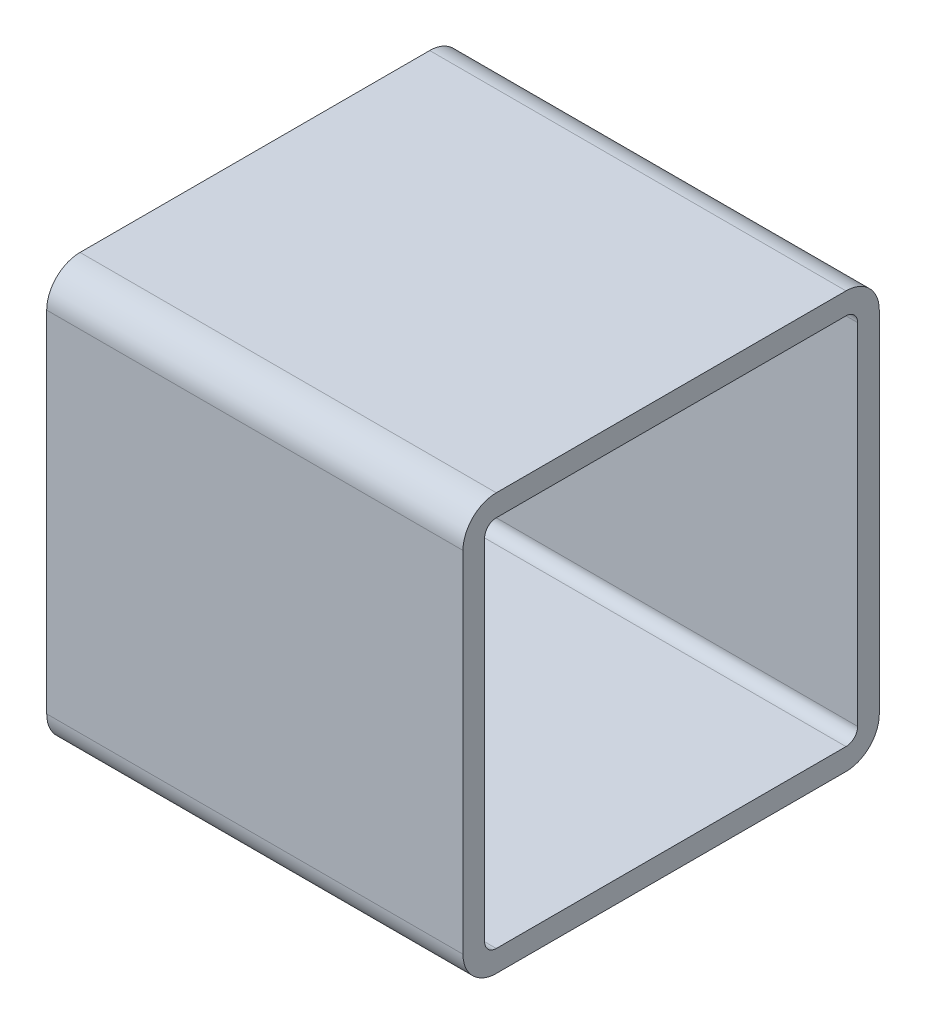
ISO-10303-21;
HEADER;
FILE_DESCRIPTION(('STEP AP214'),'2;1');
FILE_NAME('part.step','',(''),(''),'','','');
FILE_SCHEMA(('AUTOMOTIVE_DESIGN { 1 0 10303 214 1 1 1 1 }'));
ENDSEC;
DATA;
#1=APPLICATION_CONTEXT('core data for automotive mechanical design processes');
#2=APPLICATION_PROTOCOL_DEFINITION('international standard','automotive_design',2000,#1);
#3=PRODUCT_CONTEXT('',#1,'mechanical');
#4=PRODUCT('Part','Part','',(#3));
#5=PRODUCT_RELATED_PRODUCT_CATEGORY('part','',(#4));
#6=PRODUCT_DEFINITION_FORMATION('','',#4);
#7=PRODUCT_DEFINITION_CONTEXT('part definition',#1,'design');
#8=PRODUCT_DEFINITION('design','',#6,#7);
#9=PRODUCT_DEFINITION_SHAPE('','',#8);
#10=(LENGTH_UNIT() NAMED_UNIT(*) SI_UNIT(.MILLI.,.METRE.));
#11=(NAMED_UNIT(*) PLANE_ANGLE_UNIT() SI_UNIT($,.RADIAN.));
#12=(NAMED_UNIT(*) SI_UNIT($,.STERADIAN.) SOLID_ANGLE_UNIT());
#13=UNCERTAINTY_MEASURE_WITH_UNIT(LENGTH_MEASURE(1.E-05),#10,'distance_accuracy_value','');
#14=(GEOMETRIC_REPRESENTATION_CONTEXT(3) GLOBAL_UNCERTAINTY_ASSIGNED_CONTEXT((#13)) GLOBAL_UNIT_ASSIGNED_CONTEXT((#10,
#11,#12)) REPRESENTATION_CONTEXT('',''));
#15=CARTESIAN_POINT('',(0.,0.,0.));
#16=DIRECTION('',(0.,0.,1.));
#17=DIRECTION('',(1.,0.,0.));
#18=AXIS2_PLACEMENT_3D('',#15,#16,#17);
#19=CARTESIAN_POINT('',(31.75,2.54,29.21));
#20=DIRECTION('',(1.,0.,0.));
#21=DIRECTION('',(0.,0.,-1.));
#22=AXIS2_PLACEMENT_3D('',#19,#20,#21);
#23=PLANE('',#22);
#24=CARTESIAN_POINT('',(31.75,2.54,29.21));
#25=DIRECTION('',(1.,0.,0.));
#26=DIRECTION('',(0.,0.,-1.));
#27=AXIS2_PLACEMENT_3D('',#24,#25,#26);
#28=CIRCLE('',#27,2.54);
#29=CARTESIAN_POINT('',(31.75,2.54000000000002,31.75));
#30=VERTEX_POINT('',#29);
#31=CARTESIAN_POINT('',(31.75,0.,29.21));
#32=VERTEX_POINT('',#31);
#33=EDGE_CURVE('E217',#30,#32,#28,.T.);
#34=ORIENTED_EDGE('',*,*,#33,.T.);
#35=DIRECTION('',(0.,0.,-1.));
#36=VECTOR('',#35,1.);
#37=CARTESIAN_POINT('',(31.75,0.,29.21));
#38=LINE('',#37,#36);
#39=CARTESIAN_POINT('',(31.75,0.,2.54000000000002));
#40=VERTEX_POINT('',#39);
#41=EDGE_CURVE('E220',#32,#40,#38,.T.);
#42=ORIENTED_EDGE('',*,*,#41,.T.);
#43=CARTESIAN_POINT('',(31.75,2.54,2.54));
#44=DIRECTION('',(1.,0.,0.));
#45=DIRECTION('',(0.,0.,1.));
#46=AXIS2_PLACEMENT_3D('',#43,#44,#45);
#47=CIRCLE('',#46,2.54);
#48=CARTESIAN_POINT('',(31.75,2.54000000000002,0.));
#49=VERTEX_POINT('',#48);
#50=EDGE_CURVE('E223',#40,#49,#47,.T.);
#51=ORIENTED_EDGE('',*,*,#50,.T.);
#52=DIRECTION('',(0.,1.,0.));
#53=VECTOR('',#52,1.);
#54=CARTESIAN_POINT('',(31.75,2.54000000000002,0.));
#55=LINE('',#54,#53);
#56=CARTESIAN_POINT('',(31.75,29.21,0.));
#57=VERTEX_POINT('',#56);
#58=EDGE_CURVE('E225',#49,#57,#55,.T.);
#59=ORIENTED_EDGE('',*,*,#58,.T.);
#60=CARTESIAN_POINT('',(31.75,29.21,2.54));
#61=DIRECTION('',(1.,0.,0.));
#62=DIRECTION('',(0.,0.,-1.));
#63=AXIS2_PLACEMENT_3D('',#60,#61,#62);
#64=CIRCLE('',#63,2.54);
#65=CARTESIAN_POINT('',(31.75,31.75,2.54000000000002));
#66=VERTEX_POINT('',#65);
#67=EDGE_CURVE('E227',#57,#66,#64,.T.);
#68=ORIENTED_EDGE('',*,*,#67,.T.);
#69=DIRECTION('',(0.,0.,1.));
#70=VECTOR('',#69,1.);
#71=CARTESIAN_POINT('',(31.75,31.75,2.54000000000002));
#72=LINE('',#71,#70);
#73=CARTESIAN_POINT('',(31.75,31.75,29.21));
#74=VERTEX_POINT('',#73);
#75=EDGE_CURVE('E229',#66,#74,#72,.T.);
#76=ORIENTED_EDGE('',*,*,#75,.T.);
#77=CARTESIAN_POINT('',(31.75,29.21,29.21));
#78=DIRECTION('',(1.,0.,0.));
#79=DIRECTION('',(0.,0.,1.));
#80=AXIS2_PLACEMENT_3D('',#77,#78,#79);
#81=CIRCLE('',#80,2.54);
#82=CARTESIAN_POINT('',(31.75,29.21,31.75));
#83=VERTEX_POINT('',#82);
#84=EDGE_CURVE('E231',#74,#83,#81,.T.);
#85=ORIENTED_EDGE('',*,*,#84,.T.);
#86=DIRECTION('',(0.,-1.,0.));
#87=VECTOR('',#86,1.);
#88=CARTESIAN_POINT('',(31.75,29.21,31.75));
#89=LINE('',#88,#87);
#90=EDGE_CURVE('E233',#83,#30,#89,.T.);
#91=ORIENTED_EDGE('',*,*,#90,.T.);
#92=EDGE_LOOP('',(#34,#42,#51,#59,#68,#76,#85,#91));
#93=FACE_BOUND('',#92,.T.);
#94=DIRECTION('',(0.,1.,0.));
#95=VECTOR('',#94,1.);
#96=CARTESIAN_POINT('',(31.75,2.54000000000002,1.651));
#97=LINE('',#96,#95);
#98=CARTESIAN_POINT('',(31.75,2.54000000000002,1.651));
#99=VERTEX_POINT('',#98);
#100=CARTESIAN_POINT('',(31.75,29.21,1.651));
#101=VERTEX_POINT('',#100);
#102=EDGE_CURVE('E160',#99,#101,#97,.T.);
#103=ORIENTED_EDGE('',*,*,#102,.F.);
#104=CARTESIAN_POINT('',(31.75,2.54,2.54));
#105=DIRECTION('',(1.,0.,0.));
#106=DIRECTION('',(0.,0.,1.));
#107=AXIS2_PLACEMENT_3D('',#104,#105,#106);
#108=CIRCLE('',#107,0.889);
#109=CARTESIAN_POINT('',(31.75,1.651,2.54000000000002));
#110=VERTEX_POINT('',#109);
#111=EDGE_CURVE('E152',#110,#99,#108,.T.);
#112=ORIENTED_EDGE('',*,*,#111,.F.);
#113=DIRECTION('',(0.,0.,-1.));
#114=VECTOR('',#113,1.);
#115=CARTESIAN_POINT('',(31.75,1.651,29.21));
#116=LINE('',#115,#114);
#117=CARTESIAN_POINT('',(31.75,1.651,29.21));
#118=VERTEX_POINT('',#117);
#119=EDGE_CURVE('E185',#118,#110,#116,.T.);
#120=ORIENTED_EDGE('',*,*,#119,.F.);
#121=CARTESIAN_POINT('',(31.75,2.54,29.21));
#122=DIRECTION('',(1.,0.,0.));
#123=DIRECTION('',(0.,0.,-1.));
#124=AXIS2_PLACEMENT_3D('',#121,#122,#123);
#125=CIRCLE('',#124,0.889000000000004);
#126=CARTESIAN_POINT('',(31.75,2.54000000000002,30.099));
#127=VERTEX_POINT('',#126);
#128=EDGE_CURVE('E183',#127,#118,#125,.T.);
#129=ORIENTED_EDGE('',*,*,#128,.F.);
#130=DIRECTION('',(0.,-1.,0.));
#131=VECTOR('',#130,1.);
#132=CARTESIAN_POINT('',(31.75,29.21,30.099));
#133=LINE('',#132,#131);
#134=CARTESIAN_POINT('',(31.75,29.21,30.099));
#135=VERTEX_POINT('',#134);
#136=EDGE_CURVE('E181',#135,#127,#133,.T.);
#137=ORIENTED_EDGE('',*,*,#136,.F.);
#138=CARTESIAN_POINT('',(31.75,29.21,29.21));
#139=DIRECTION('',(1.,0.,0.));
#140=DIRECTION('',(0.,0.,1.));
#141=AXIS2_PLACEMENT_3D('',#138,#139,#140);
#142=CIRCLE('',#141,0.889000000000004);
#143=CARTESIAN_POINT('',(31.75,30.099,29.21));
#144=VERTEX_POINT('',#143);
#145=EDGE_CURVE('E179',#144,#135,#142,.T.);
#146=ORIENTED_EDGE('',*,*,#145,.F.);
#147=DIRECTION('',(0.,0.,1.));
#148=VECTOR('',#147,1.);
#149=CARTESIAN_POINT('',(31.75,30.099,2.54000000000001));
#150=LINE('',#149,#148);
#151=CARTESIAN_POINT('',(31.75,30.099,2.54000000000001));
#152=VERTEX_POINT('',#151);
#153=EDGE_CURVE('E175',#152,#144,#150,.T.);
#154=ORIENTED_EDGE('',*,*,#153,.F.);
#155=CARTESIAN_POINT('',(31.75,29.21,2.54));
#156=DIRECTION('',(1.,0.,0.));
#157=DIRECTION('',(0.,0.,-1.));
#158=AXIS2_PLACEMENT_3D('',#155,#156,#157);
#159=CIRCLE('',#158,0.889);
#160=EDGE_CURVE('E173',#101,#152,#159,.T.);
#161=ORIENTED_EDGE('',*,*,#160,.F.);
#162=EDGE_LOOP('',(#103,#112,#120,#129,#137,#146,#154,#161));
#163=FACE_BOUND('',#162,.T.);
#164=ADVANCED_FACE('F39',(#93,#163),#23,.T.);
#165=CARTESIAN_POINT('',(0.,2.54,29.21));
#166=DIRECTION('',(1.,0.,0.));
#167=DIRECTION('',(0.,0.,-1.));
#168=AXIS2_PLACEMENT_3D('',#165,#166,#167);
#169=PLANE('',#168);
#170=CARTESIAN_POINT('',(0.,2.54,29.21));
#171=DIRECTION('',(1.,0.,0.));
#172=DIRECTION('',(0.,0.,-1.));
#173=AXIS2_PLACEMENT_3D('',#170,#171,#172);
#174=CIRCLE('',#173,2.54);
#175=CARTESIAN_POINT('',(0.,2.54000000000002,31.75));
#176=VERTEX_POINT('',#175);
#177=CARTESIAN_POINT('',(0.,0.,29.21));
#178=VERTEX_POINT('',#177);
#179=EDGE_CURVE('E168',#176,#178,#174,.T.);
#180=ORIENTED_EDGE('',*,*,#179,.F.);
#181=DIRECTION('',(0.,-1.,0.));
#182=VECTOR('',#181,1.);
#183=CARTESIAN_POINT('',(0.,29.21,31.75));
#184=LINE('',#183,#182);
#185=CARTESIAN_POINT('',(0.,29.21,31.75));
#186=VERTEX_POINT('',#185);
#187=EDGE_CURVE('E221',#186,#176,#184,.T.);
#188=ORIENTED_EDGE('',*,*,#187,.F.);
#189=CARTESIAN_POINT('',(0.,29.21,29.21));
#190=DIRECTION('',(1.,0.,0.));
#191=DIRECTION('',(0.,0.,1.));
#192=AXIS2_PLACEMENT_3D('',#189,#190,#191);
#193=CIRCLE('',#192,2.54);
#194=CARTESIAN_POINT('',(0.,31.75,29.21));
#195=VERTEX_POINT('',#194);
#196=EDGE_CURVE('E248',#195,#186,#193,.T.);
#197=ORIENTED_EDGE('',*,*,#196,.F.);
#198=DIRECTION('',(0.,0.,1.));
#199=VECTOR('',#198,1.);
#200=CARTESIAN_POINT('',(0.,31.75,2.54000000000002));
#201=LINE('',#200,#199);
#202=CARTESIAN_POINT('',(0.,31.75,2.54000000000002));
#203=VERTEX_POINT('',#202);
#204=EDGE_CURVE('E246',#203,#195,#201,.T.);
#205=ORIENTED_EDGE('',*,*,#204,.F.);
#206=CARTESIAN_POINT('',(0.,29.21,2.54));
#207=DIRECTION('',(1.,0.,0.));
#208=DIRECTION('',(0.,0.,-1.));
#209=AXIS2_PLACEMENT_3D('',#206,#207,#208);
#210=CIRCLE('',#209,2.54);
#211=CARTESIAN_POINT('',(0.,29.21,0.));
#212=VERTEX_POINT('',#211);
#213=EDGE_CURVE('E244',#212,#203,#210,.T.);
#214=ORIENTED_EDGE('',*,*,#213,.F.);
#215=DIRECTION('',(0.,1.,0.));
#216=VECTOR('',#215,1.);
#217=CARTESIAN_POINT('',(0.,2.54000000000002,0.));
#218=LINE('',#217,#216);
#219=CARTESIAN_POINT('',(0.,2.54000000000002,0.));
#220=VERTEX_POINT('',#219);
#221=EDGE_CURVE('E242',#220,#212,#218,.T.);
#222=ORIENTED_EDGE('',*,*,#221,.F.);
#223=CARTESIAN_POINT('',(0.,2.54,2.54));
#224=DIRECTION('',(1.,0.,0.));
#225=DIRECTION('',(0.,0.,1.));
#226=AXIS2_PLACEMENT_3D('',#223,#224,#225);
#227=CIRCLE('',#226,2.54);
#228=CARTESIAN_POINT('',(0.,0.,2.54000000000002));
#229=VERTEX_POINT('',#228);
#230=EDGE_CURVE('E240',#229,#220,#227,.T.);
#231=ORIENTED_EDGE('',*,*,#230,.F.);
#232=DIRECTION('',(0.,0.,-1.));
#233=VECTOR('',#232,1.);
#234=CARTESIAN_POINT('',(0.,0.,29.21));
#235=LINE('',#234,#233);
#236=EDGE_CURVE('E238',#178,#229,#235,.T.);
#237=ORIENTED_EDGE('',*,*,#236,.F.);
#238=EDGE_LOOP('',(#180,#188,#197,#205,#214,#222,#231,#237));
#239=FACE_BOUND('',#238,.T.);
#240=CARTESIAN_POINT('',(0.,2.54,2.54));
#241=DIRECTION('',(1.,0.,0.));
#242=DIRECTION('',(0.,0.,1.));
#243=AXIS2_PLACEMENT_3D('',#240,#241,#242);
#244=CIRCLE('',#243,0.889);
#245=CARTESIAN_POINT('',(0.,1.651,2.54000000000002));
#246=VERTEX_POINT('',#245);
#247=CARTESIAN_POINT('',(0.,2.54000000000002,1.651));
#248=VERTEX_POINT('',#247);
#249=EDGE_CURVE('E62',#246,#248,#244,.T.);
#250=ORIENTED_EDGE('',*,*,#249,.T.);
#251=DIRECTION('',(0.,1.,0.));
#252=VECTOR('',#251,1.);
#253=CARTESIAN_POINT('',(0.,2.54000000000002,1.651));
#254=LINE('',#253,#252);
#255=CARTESIAN_POINT('',(0.,29.21,1.651));
#256=VERTEX_POINT('',#255);
#257=EDGE_CURVE('E167',#248,#256,#254,.T.);
#258=ORIENTED_EDGE('',*,*,#257,.T.);
#259=CARTESIAN_POINT('',(0.,29.21,2.54));
#260=DIRECTION('',(1.,0.,0.));
#261=DIRECTION('',(0.,0.,-1.));
#262=AXIS2_PLACEMENT_3D('',#259,#260,#261);
#263=CIRCLE('',#262,0.889);
#264=CARTESIAN_POINT('',(0.,30.099,2.54000000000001));
#265=VERTEX_POINT('',#264);
#266=EDGE_CURVE('E189',#256,#265,#263,.T.);
#267=ORIENTED_EDGE('',*,*,#266,.T.);
#268=DIRECTION('',(0.,0.,1.));
#269=VECTOR('',#268,1.);
#270=CARTESIAN_POINT('',(0.,30.099,2.54000000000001));
#271=LINE('',#270,#269);
#272=CARTESIAN_POINT('',(0.,30.099,29.21));
#273=VERTEX_POINT('',#272);
#274=EDGE_CURVE('E192',#265,#273,#271,.T.);
#275=ORIENTED_EDGE('',*,*,#274,.T.);
#276=CARTESIAN_POINT('',(0.,29.21,29.21));
#277=DIRECTION('',(1.,0.,0.));
#278=DIRECTION('',(0.,0.,1.));
#279=AXIS2_PLACEMENT_3D('',#276,#277,#278);
#280=CIRCLE('',#279,0.889000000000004);
#281=CARTESIAN_POINT('',(0.,29.21,30.099));
#282=VERTEX_POINT('',#281);
#283=EDGE_CURVE('E195',#273,#282,#280,.T.);
#284=ORIENTED_EDGE('',*,*,#283,.T.);
#285=DIRECTION('',(0.,-1.,0.));
#286=VECTOR('',#285,1.);
#287=CARTESIAN_POINT('',(0.,29.21,30.099));
#288=LINE('',#287,#286);
#289=CARTESIAN_POINT('',(0.,2.54000000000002,30.099));
#290=VERTEX_POINT('',#289);
#291=EDGE_CURVE('E198',#282,#290,#288,.T.);
#292=ORIENTED_EDGE('',*,*,#291,.T.);
#293=CARTESIAN_POINT('',(0.,2.54,29.21));
#294=DIRECTION('',(1.,0.,0.));
#295=DIRECTION('',(0.,0.,-1.));
#296=AXIS2_PLACEMENT_3D('',#293,#294,#295);
#297=CIRCLE('',#296,0.889000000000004);
#298=CARTESIAN_POINT('',(0.,1.651,29.21));
#299=VERTEX_POINT('',#298);
#300=EDGE_CURVE('E201',#290,#299,#297,.T.);
#301=ORIENTED_EDGE('',*,*,#300,.T.);
#302=DIRECTION('',(0.,0.,-1.));
#303=VECTOR('',#302,1.);
#304=CARTESIAN_POINT('',(0.,1.651,29.21));
#305=LINE('',#304,#303);
#306=EDGE_CURVE('E161',#299,#246,#305,.T.);
#307=ORIENTED_EDGE('',*,*,#306,.T.);
#308=EDGE_LOOP('',(#250,#258,#267,#275,#284,#292,#301,#307));
#309=FACE_BOUND('',#308,.T.);
#310=ADVANCED_FACE('F278',(#239,#309),#169,.F.);
#311=CARTESIAN_POINT('',(31.75,2.54,29.21));
#312=DIRECTION('',(-1.,0.,0.));
#313=DIRECTION('',(0.,0.,1.));
#314=AXIS2_PLACEMENT_3D('',#311,#312,#313);
#315=CYLINDRICAL_SURFACE('',#314,2.54);
#316=ORIENTED_EDGE('',*,*,#179,.T.);
#317=DIRECTION('',(-1.,0.,0.));
#318=VECTOR('',#317,1.);
#319=CARTESIAN_POINT('',(31.75,0.,29.21));
#320=LINE('',#319,#318);
#321=EDGE_CURVE('E11',#32,#178,#320,.T.);
#322=ORIENTED_EDGE('',*,*,#321,.F.);
#323=ORIENTED_EDGE('',*,*,#33,.F.);
#324=DIRECTION('',(-1.,0.,0.));
#325=VECTOR('',#324,1.);
#326=CARTESIAN_POINT('',(31.75,2.54000000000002,31.75));
#327=LINE('',#326,#325);
#328=EDGE_CURVE('E235',#30,#176,#327,.T.);
#329=ORIENTED_EDGE('',*,*,#328,.T.);
#330=EDGE_LOOP('',(#316,#322,#323,#329));
#331=FACE_BOUND('',#330,.T.);
#332=ADVANCED_FACE('F41',(#331),#315,.T.);
#333=CARTESIAN_POINT('',(31.75,0.,29.21));
#334=DIRECTION('',(0.,1.,0.));
#335=DIRECTION('',(0.,0.,1.));
#336=AXIS2_PLACEMENT_3D('',#333,#334,#335);
#337=PLANE('',#336);
#338=ORIENTED_EDGE('',*,*,#236,.T.);
#339=DIRECTION('',(-1.,0.,0.));
#340=VECTOR('',#339,1.);
#341=CARTESIAN_POINT('',(31.75,0.,2.54000000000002));
#342=LINE('',#341,#340);
#343=EDGE_CURVE('E47',#40,#229,#342,.T.);
#344=ORIENTED_EDGE('',*,*,#343,.F.);
#345=ORIENTED_EDGE('',*,*,#41,.F.);
#346=ORIENTED_EDGE('',*,*,#321,.T.);
#347=EDGE_LOOP('',(#338,#344,#345,#346));
#348=FACE_BOUND('',#347,.T.);
#349=ADVANCED_FACE('F295',(#348),#337,.F.);
#350=CARTESIAN_POINT('',(31.75,2.54,2.54));
#351=DIRECTION('',(-1.,0.,0.));
#352=DIRECTION('',(0.,0.,1.));
#353=AXIS2_PLACEMENT_3D('',#350,#351,#352);
#354=CYLINDRICAL_SURFACE('',#353,2.54);
#355=ORIENTED_EDGE('',*,*,#230,.T.);
#356=DIRECTION('',(-1.,0.,0.));
#357=VECTOR('',#356,1.);
#358=CARTESIAN_POINT('',(31.75,2.54000000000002,0.));
#359=LINE('',#358,#357);
#360=EDGE_CURVE('E265',#49,#220,#359,.T.);
#361=ORIENTED_EDGE('',*,*,#360,.F.);
#362=ORIENTED_EDGE('',*,*,#50,.F.);
#363=ORIENTED_EDGE('',*,*,#343,.T.);
#364=EDGE_LOOP('',(#355,#361,#362,#363));
#365=FACE_BOUND('',#364,.T.);
#366=ADVANCED_FACE('F272',(#365),#354,.T.);
#367=CARTESIAN_POINT('',(31.75,2.54000000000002,0.));
#368=DIRECTION('',(0.,0.,1.));
#369=DIRECTION('',(1.,0.,0.));
#370=AXIS2_PLACEMENT_3D('',#367,#368,#369);
#371=PLANE('',#370);
#372=ORIENTED_EDGE('',*,*,#221,.T.);
#373=DIRECTION('',(-1.,0.,0.));
#374=VECTOR('',#373,1.);
#375=CARTESIAN_POINT('',(31.75,29.21,0.));
#376=LINE('',#375,#374);
#377=EDGE_CURVE('E262',#57,#212,#376,.T.);
#378=ORIENTED_EDGE('',*,*,#377,.F.);
#379=ORIENTED_EDGE('',*,*,#58,.F.);
#380=ORIENTED_EDGE('',*,*,#360,.T.);
#381=EDGE_LOOP('',(#372,#378,#379,#380));
#382=FACE_BOUND('',#381,.T.);
#383=ADVANCED_FACE('F284',(#382),#371,.F.);
#384=CARTESIAN_POINT('',(31.75,29.21,2.54));
#385=DIRECTION('',(-1.,0.,0.));
#386=DIRECTION('',(0.,0.,1.));
#387=AXIS2_PLACEMENT_3D('',#384,#385,#386);
#388=CYLINDRICAL_SURFACE('',#387,2.54);
#389=ORIENTED_EDGE('',*,*,#213,.T.);
#390=DIRECTION('',(-1.,0.,0.));
#391=VECTOR('',#390,1.);
#392=CARTESIAN_POINT('',(31.75,31.75,2.54000000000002));
#393=LINE('',#392,#391);
#394=EDGE_CURVE('E259',#66,#203,#393,.T.);
#395=ORIENTED_EDGE('',*,*,#394,.F.);
#396=ORIENTED_EDGE('',*,*,#67,.F.);
#397=ORIENTED_EDGE('',*,*,#377,.T.);
#398=EDGE_LOOP('',(#389,#395,#396,#397));
#399=FACE_BOUND('',#398,.T.);
#400=ADVANCED_FACE('F288',(#399),#388,.T.);
#401=CARTESIAN_POINT('',(31.75,31.75,2.54000000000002));
#402=DIRECTION('',(0.,-1.,0.));
#403=DIRECTION('',(0.,0.,-1.));
#404=AXIS2_PLACEMENT_3D('',#401,#402,#403);
#405=PLANE('',#404);
#406=ORIENTED_EDGE('',*,*,#204,.T.);
#407=DIRECTION('',(-1.,0.,0.));
#408=VECTOR('',#407,1.);
#409=CARTESIAN_POINT('',(31.75,31.75,29.21));
#410=LINE('',#409,#408);
#411=EDGE_CURVE('E256',#74,#195,#410,.T.);
#412=ORIENTED_EDGE('',*,*,#411,.F.);
#413=ORIENTED_EDGE('',*,*,#75,.F.);
#414=ORIENTED_EDGE('',*,*,#394,.T.);
#415=EDGE_LOOP('',(#406,#412,#413,#414));
#416=FACE_BOUND('',#415,.T.);
#417=ADVANCED_FACE('F308',(#416),#405,.F.);
#418=CARTESIAN_POINT('',(31.75,29.21,29.21));
#419=DIRECTION('',(-1.,0.,0.));
#420=DIRECTION('',(0.,0.,1.));
#421=AXIS2_PLACEMENT_3D('',#418,#419,#420);
#422=CYLINDRICAL_SURFACE('',#421,2.54);
#423=ORIENTED_EDGE('',*,*,#196,.T.);
#424=DIRECTION('',(-1.,0.,0.));
#425=VECTOR('',#424,1.);
#426=CARTESIAN_POINT('',(31.75,29.21,31.75));
#427=LINE('',#426,#425);
#428=EDGE_CURVE('E253',#83,#186,#427,.T.);
#429=ORIENTED_EDGE('',*,*,#428,.F.);
#430=ORIENTED_EDGE('',*,*,#84,.F.);
#431=ORIENTED_EDGE('',*,*,#411,.T.);
#432=EDGE_LOOP('',(#423,#429,#430,#431));
#433=FACE_BOUND('',#432,.T.);
#434=ADVANCED_FACE('F306',(#433),#422,.T.);
#435=CARTESIAN_POINT('',(31.75,29.21,31.75));
#436=DIRECTION('',(0.,0.,-1.));
#437=DIRECTION('',(0.,1.,0.));
#438=AXIS2_PLACEMENT_3D('',#435,#436,#437);
#439=PLANE('',#438);
#440=ORIENTED_EDGE('',*,*,#187,.T.);
#441=ORIENTED_EDGE('',*,*,#328,.F.);
#442=ORIENTED_EDGE('',*,*,#90,.F.);
#443=ORIENTED_EDGE('',*,*,#428,.T.);
#444=EDGE_LOOP('',(#440,#441,#442,#443));
#445=FACE_BOUND('',#444,.T.);
#446=ADVANCED_FACE('F301',(#445),#439,.F.);
#447=CARTESIAN_POINT('',(31.75,2.54,2.54));
#448=DIRECTION('',(-1.,0.,0.));
#449=DIRECTION('',(0.,0.,1.));
#450=AXIS2_PLACEMENT_3D('',#447,#448,#449);
#451=CYLINDRICAL_SURFACE('',#450,0.889);
#452=ORIENTED_EDGE('',*,*,#249,.F.);
#453=DIRECTION('',(-1.,0.,0.));
#454=VECTOR('',#453,1.);
#455=CARTESIAN_POINT('',(31.75,1.651,2.54000000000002));
#456=LINE('',#455,#454);
#457=EDGE_CURVE('E156',#110,#246,#456,.T.);
#458=ORIENTED_EDGE('',*,*,#457,.F.);
#459=ORIENTED_EDGE('',*,*,#111,.T.);
#460=DIRECTION('',(-1.,0.,0.));
#461=VECTOR('',#460,1.);
#462=CARTESIAN_POINT('',(31.75,2.54000000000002,1.651));
#463=LINE('',#462,#461);
#464=EDGE_CURVE('E155',#99,#248,#463,.T.);
#465=ORIENTED_EDGE('',*,*,#464,.T.);
#466=EDGE_LOOP('',(#452,#458,#459,#465));
#467=FACE_BOUND('',#466,.T.);
#468=ADVANCED_FACE('F154',(#467),#451,.F.);
#469=CARTESIAN_POINT('',(31.75,2.54000000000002,1.651));
#470=DIRECTION('',(0.,0.,1.));
#471=DIRECTION('',(1.,0.,0.));
#472=AXIS2_PLACEMENT_3D('',#469,#470,#471);
#473=PLANE('',#472);
#474=ORIENTED_EDGE('',*,*,#257,.F.);
#475=ORIENTED_EDGE('',*,*,#464,.F.);
#476=ORIENTED_EDGE('',*,*,#102,.T.);
#477=DIRECTION('',(-1.,0.,0.));
#478=VECTOR('',#477,1.);
#479=CARTESIAN_POINT('',(31.75,29.21,1.651));
#480=LINE('',#479,#478);
#481=EDGE_CURVE('E169',#101,#256,#480,.T.);
#482=ORIENTED_EDGE('',*,*,#481,.T.);
#483=EDGE_LOOP('',(#474,#475,#476,#482));
#484=FACE_BOUND('',#483,.T.);
#485=ADVANCED_FACE('F164',(#484),#473,.T.);
#486=CARTESIAN_POINT('',(31.75,29.21,2.54));
#487=DIRECTION('',(-1.,0.,0.));
#488=DIRECTION('',(0.,0.,1.));
#489=AXIS2_PLACEMENT_3D('',#486,#487,#488);
#490=CYLINDRICAL_SURFACE('',#489,0.889);
#491=ORIENTED_EDGE('',*,*,#266,.F.);
#492=ORIENTED_EDGE('',*,*,#481,.F.);
#493=ORIENTED_EDGE('',*,*,#160,.T.);
#494=DIRECTION('',(-1.,0.,0.));
#495=VECTOR('',#494,1.);
#496=CARTESIAN_POINT('',(31.75,30.099,2.54000000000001));
#497=LINE('',#496,#495);
#498=EDGE_CURVE('E214',#152,#265,#497,.T.);
#499=ORIENTED_EDGE('',*,*,#498,.T.);
#500=EDGE_LOOP('',(#491,#492,#493,#499));
#501=FACE_BOUND('',#500,.T.);
#502=ADVANCED_FACE('F333',(#501),#490,.F.);
#503=CARTESIAN_POINT('',(31.75,30.099,2.54000000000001));
#504=DIRECTION('',(0.,-1.,0.));
#505=DIRECTION('',(0.,0.,-1.));
#506=AXIS2_PLACEMENT_3D('',#503,#504,#505);
#507=PLANE('',#506);
#508=ORIENTED_EDGE('',*,*,#274,.F.);
#509=ORIENTED_EDGE('',*,*,#498,.F.);
#510=ORIENTED_EDGE('',*,*,#153,.T.);
#511=DIRECTION('',(-1.,0.,0.));
#512=VECTOR('',#511,1.);
#513=CARTESIAN_POINT('',(31.75,30.099,29.21));
#514=LINE('',#513,#512);
#515=EDGE_CURVE('E212',#144,#273,#514,.T.);
#516=ORIENTED_EDGE('',*,*,#515,.T.);
#517=EDGE_LOOP('',(#508,#509,#510,#516));
#518=FACE_BOUND('',#517,.T.);
#519=ADVANCED_FACE('F337',(#518),#507,.T.);
#520=CARTESIAN_POINT('',(31.75,29.21,29.21));
#521=DIRECTION('',(-1.,0.,0.));
#522=DIRECTION('',(0.,0.,1.));
#523=AXIS2_PLACEMENT_3D('',#520,#521,#522);
#524=CYLINDRICAL_SURFACE('',#523,0.889000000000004);
#525=ORIENTED_EDGE('',*,*,#283,.F.);
#526=ORIENTED_EDGE('',*,*,#515,.F.);
#527=ORIENTED_EDGE('',*,*,#145,.T.);
#528=DIRECTION('',(-1.,0.,0.));
#529=VECTOR('',#528,1.);
#530=CARTESIAN_POINT('',(31.75,29.21,30.099));
#531=LINE('',#530,#529);
#532=EDGE_CURVE('E210',#135,#282,#531,.T.);
#533=ORIENTED_EDGE('',*,*,#532,.T.);
#534=EDGE_LOOP('',(#525,#526,#527,#533));
#535=FACE_BOUND('',#534,.T.);
#536=ADVANCED_FACE('F343',(#535),#524,.F.);
#537=CARTESIAN_POINT('',(31.75,29.21,30.099));
#538=DIRECTION('',(0.,0.,-1.));
#539=DIRECTION('',(-1.,0.,0.));
#540=AXIS2_PLACEMENT_3D('',#537,#538,#539);
#541=PLANE('',#540);
#542=ORIENTED_EDGE('',*,*,#291,.F.);
#543=ORIENTED_EDGE('',*,*,#532,.F.);
#544=ORIENTED_EDGE('',*,*,#136,.T.);
#545=DIRECTION('',(-1.,0.,0.));
#546=VECTOR('',#545,1.);
#547=CARTESIAN_POINT('',(31.75,2.54000000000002,30.099));
#548=LINE('',#547,#546);
#549=EDGE_CURVE('E208',#127,#290,#548,.T.);
#550=ORIENTED_EDGE('',*,*,#549,.T.);
#551=EDGE_LOOP('',(#542,#543,#544,#550));
#552=FACE_BOUND('',#551,.T.);
#553=ADVANCED_FACE('F347',(#552),#541,.T.);
#554=CARTESIAN_POINT('',(31.75,2.54,29.21));
#555=DIRECTION('',(-1.,0.,0.));
#556=DIRECTION('',(0.,0.,1.));
#557=AXIS2_PLACEMENT_3D('',#554,#555,#556);
#558=CYLINDRICAL_SURFACE('',#557,0.889000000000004);
#559=ORIENTED_EDGE('',*,*,#300,.F.);
#560=ORIENTED_EDGE('',*,*,#549,.F.);
#561=ORIENTED_EDGE('',*,*,#128,.T.);
#562=DIRECTION('',(-1.,0.,0.));
#563=VECTOR('',#562,1.);
#564=CARTESIAN_POINT('',(31.75,1.651,29.21));
#565=LINE('',#564,#563);
#566=EDGE_CURVE('E54',#118,#299,#565,.T.);
#567=ORIENTED_EDGE('',*,*,#566,.T.);
#568=EDGE_LOOP('',(#559,#560,#561,#567));
#569=FACE_BOUND('',#568,.T.);
#570=ADVANCED_FACE('F351',(#569),#558,.F.);
#571=CARTESIAN_POINT('',(31.75,1.651,29.21));
#572=DIRECTION('',(0.,1.,0.));
#573=DIRECTION('',(0.,0.,1.));
#574=AXIS2_PLACEMENT_3D('',#571,#572,#573);
#575=PLANE('',#574);
#576=ORIENTED_EDGE('',*,*,#306,.F.);
#577=ORIENTED_EDGE('',*,*,#566,.F.);
#578=ORIENTED_EDGE('',*,*,#119,.T.);
#579=ORIENTED_EDGE('',*,*,#457,.T.);
#580=EDGE_LOOP('',(#576,#577,#578,#579));
#581=FACE_BOUND('',#580,.T.);
#582=ADVANCED_FACE('F355',(#581),#575,.T.);
#583=CLOSED_SHELL('',(#164,#310,#332,#349,#366,#383,#400,#417,#434,#446,#468,#485,#502,#519,
#536,#553,#570,#582));
#584=MANIFOLD_SOLID_BREP('B2',#583);
#585=ADVANCED_BREP_SHAPE_REPRESENTATION('',(#18,#584),#14);
#586=SHAPE_DEFINITION_REPRESENTATION(#9,#585);
ENDSEC;
END-ISO-10303-21;
